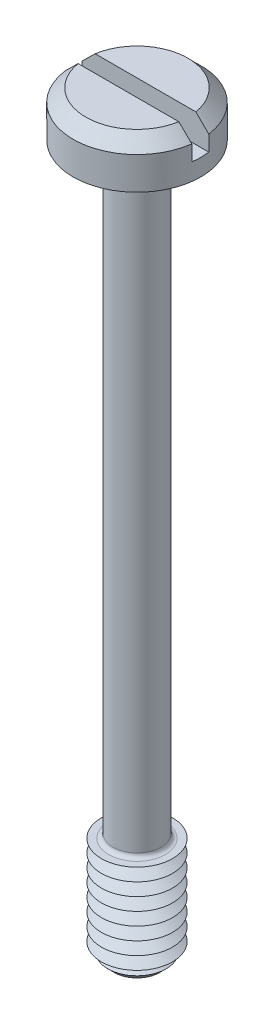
ISO-10303-21;
HEADER;
FILE_DESCRIPTION(('STEP AP214'),'2;1');
FILE_NAME('part.step','',(''),(''),'','','');
FILE_SCHEMA(('AUTOMOTIVE_DESIGN { 1 0 10303 214 1 1 1 1 }'));
ENDSEC;
DATA;
#1=APPLICATION_CONTEXT('core data for automotive mechanical design processes');
#2=APPLICATION_PROTOCOL_DEFINITION('international standard','automotive_design',2000,#1);
#3=PRODUCT_CONTEXT('',#1,'mechanical');
#4=PRODUCT('Part','Part','',(#3));
#5=PRODUCT_RELATED_PRODUCT_CATEGORY('part','',(#4));
#6=PRODUCT_DEFINITION_FORMATION('','',#4);
#7=PRODUCT_DEFINITION_CONTEXT('part definition',#1,'design');
#8=PRODUCT_DEFINITION('design','',#6,#7);
#9=PRODUCT_DEFINITION_SHAPE('','',#8);
#10=(LENGTH_UNIT() NAMED_UNIT(*) SI_UNIT(.MILLI.,.METRE.));
#11=(NAMED_UNIT(*) PLANE_ANGLE_UNIT() SI_UNIT($,.RADIAN.));
#12=(NAMED_UNIT(*) SI_UNIT($,.STERADIAN.) SOLID_ANGLE_UNIT());
#13=UNCERTAINTY_MEASURE_WITH_UNIT(LENGTH_MEASURE(1.E-05),#10,'distance_accuracy_value','');
#14=(GEOMETRIC_REPRESENTATION_CONTEXT(3) GLOBAL_UNCERTAINTY_ASSIGNED_CONTEXT((#13)) GLOBAL_UNIT_ASSIGNED_CONTEXT((#10,
#11,#12)) REPRESENTATION_CONTEXT('',''));
#15=CARTESIAN_POINT('',(0.,0.,0.));
#16=DIRECTION('',(0.,0.,1.));
#17=DIRECTION('',(1.,0.,0.));
#18=AXIS2_PLACEMENT_3D('',#15,#16,#17);
#19=CARTESIAN_POINT('',(0.,1.6,0.));
#20=DIRECTION('',(0.,1.,0.));
#21=DIRECTION('',(0.,0.,1.));
#22=AXIS2_PLACEMENT_3D('',#19,#20,#21);
#23=PLANE('',#22);
#24=DIRECTION('',(-1.,0.,0.));
#25=VECTOR('',#24,1.);
#26=CARTESIAN_POINT('',(2.25,1.6,-0.3));
#27=LINE('',#26,#25);
#28=CARTESIAN_POINT('',(1.77482393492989,1.6,-0.3));
#29=VERTEX_POINT('',#28);
#30=CARTESIAN_POINT('',(-1.77482393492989,1.6,-0.3));
#31=VERTEX_POINT('',#30);
#32=EDGE_CURVE('E110',#29,#31,#27,.T.);
#33=ORIENTED_EDGE('',*,*,#32,.F.);
#34=CARTESIAN_POINT('',(0.,1.6,0.));
#35=DIRECTION('',(0.,1.,0.));
#36=DIRECTION('',(0.,0.,1.));
#37=AXIS2_PLACEMENT_3D('',#34,#35,#36);
#38=CIRCLE('',#37,1.8);
#39=EDGE_CURVE('E113',#29,#31,#38,.T.);
#40=ORIENTED_EDGE('',*,*,#39,.T.);
#41=EDGE_LOOP('',(#33,#40));
#42=FACE_BOUND('',#41,.T.);
#43=ADVANCED_FACE('F39',(#42),#23,.T.);
#44=CARTESIAN_POINT('',(0.,1.6,0.));
#45=DIRECTION('',(0.,-1.,0.));
#46=DIRECTION('',(0.,0.,-1.));
#47=AXIS2_PLACEMENT_3D('',#44,#45,#46);
#48=CONICAL_SURFACE('',#47,1.8,0.785398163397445);
#49=CARTESIAN_POINT('',(4.95459224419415,-1.56366641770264,-0.3));
#50=CARTESIAN_POINT('',(4.78550585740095,-1.39489159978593,-0.3));
#51=CARTESIAN_POINT('',(4.61640599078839,-1.22613027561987,-0.3));
#52=CARTESIAN_POINT('',(4.27815962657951,-0.888649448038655,-0.3));
#53=CARTESIAN_POINT('',(4.10901312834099,-0.71992994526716,-0.3));
#54=CARTESIAN_POINT('',(3.77060374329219,-0.382497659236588,-0.3));
#55=CARTESIAN_POINT('',(3.601340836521,-0.213784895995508,-0.3));
#56=CARTESIAN_POINT('',(3.26272497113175,0.123545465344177,-0.3));
#57=CARTESIAN_POINT('',(3.0933720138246,0.292163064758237,-0.3));
#58=CARTESIAN_POINT('',(2.74975444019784,0.633985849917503,-0.3));
#59=CARTESIAN_POINT('',(2.57548557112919,0.807186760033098,-0.3));
#60=CARTESIAN_POINT('',(2.22666801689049,1.15332162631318,-0.3));
#61=CARTESIAN_POINT('',(2.05211932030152,1.32625557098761,-0.3));
#62=CARTESIAN_POINT('',(1.78988225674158,1.58520097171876,-0.3));
#63=CARTESIAN_POINT('',(1.70241000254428,1.67143125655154,-0.3));
#64=CARTESIAN_POINT('',(1.52723599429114,1.84366185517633,-0.3));
#65=CARTESIAN_POINT('',(1.43953423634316,1.92966216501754,-0.3));
#66=CARTESIAN_POINT('',(1.26375483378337,2.10126365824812,-0.3));
#67=CARTESIAN_POINT('',(1.17567721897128,2.18686487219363,-0.3));
#68=CARTESIAN_POINT('',(0.998839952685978,2.35735922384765,-0.3));
#69=CARTESIAN_POINT('',(0.910080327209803,2.44225238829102,-0.3));
#70=CARTESIAN_POINT('',(0.796416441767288,2.54899153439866,-0.3));
#71=CARTESIAN_POINT('',(0.772225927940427,2.57159630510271,-0.3));
#72=CARTESIAN_POINT('',(0.723692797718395,2.61664290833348,-0.3));
#73=CARTESIAN_POINT('',(0.69935017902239,2.6390847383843,-0.3));
#74=CARTESIAN_POINT('',(0.65052808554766,2.68369783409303,-0.3));
#75=CARTESIAN_POINT('',(0.626049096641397,2.70586963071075,-0.3));
#76=CARTESIAN_POINT('',(0.576826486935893,2.74991696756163,-0.3));
#77=CARTESIAN_POINT('',(0.552082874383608,2.7717925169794,-0.3));
#78=CARTESIAN_POINT('',(0.495367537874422,2.82108684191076,-0.3));
#79=CARTESIAN_POINT('',(0.463281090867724,2.84837386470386,-0.3));
#80=CARTESIAN_POINT('',(0.398023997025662,2.90193742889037,-0.3));
#81=CARTESIAN_POINT('',(0.364849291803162,2.92820913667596,-0.3));
#82=CARTESIAN_POINT('',(0.313679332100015,2.96610502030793,-0.3));
#83=CARTESIAN_POINT('',(0.296293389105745,2.97854603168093,-0.3));
#84=CARTESIAN_POINT('',(0.260958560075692,3.0025951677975,-0.3));
#85=CARTESIAN_POINT('',(0.243009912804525,3.0142036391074,-0.3));
#86=CARTESIAN_POINT('',(0.206442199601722,3.0361249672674,-0.3));
#87=CARTESIAN_POINT('',(0.187826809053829,3.04644383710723,-0.3));
#88=CARTESIAN_POINT('',(0.149667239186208,3.06515059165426,-0.3));
#89=CARTESIAN_POINT('',(0.130125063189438,3.07354243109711,-0.3));
#90=CARTESIAN_POINT('',(0.0899770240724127,3.08736060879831,-0.3));
#91=CARTESIAN_POINT('',(0.0693720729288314,3.09278944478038,-0.3));
#92=CARTESIAN_POINT('',(0.0275643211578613,3.0994305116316,-0.3));
#93=CARTESIAN_POINT('',(0.00636584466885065,3.10066782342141,-0.3));
#94=CARTESIAN_POINT('',(-0.0358007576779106,3.09861060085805,-0.3));
#95=CARTESIAN_POINT('',(-0.0567687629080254,3.09531379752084,-0.3));
#96=CARTESIAN_POINT('',(-0.0978737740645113,3.085078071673,-0.3));
#97=CARTESIAN_POINT('',(-0.118004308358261,3.07811501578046,-0.3));
#98=CARTESIAN_POINT('',(-0.162483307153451,3.05957916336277,-0.3));
#99=CARTESIAN_POINT('',(-0.186511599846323,3.04727044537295,-0.3));
#100=CARTESIAN_POINT('',(-0.233318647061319,3.02043354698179,-0.3));
#101=CARTESIAN_POINT('',(-0.256093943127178,3.00589960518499,-0.3));
#102=CARTESIAN_POINT('',(-0.300901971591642,2.97541580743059,-0.3));
#103=CARTESIAN_POINT('',(-0.322928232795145,2.95945657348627,-0.3));
#104=CARTESIAN_POINT('',(-0.366316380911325,2.9267282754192,-0.3));
#105=CARTESIAN_POINT('',(-0.387679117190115,2.90996032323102,-0.3));
#106=CARTESIAN_POINT('',(-0.433394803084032,2.87310399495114,-0.3));
#107=CARTESIAN_POINT('',(-0.457669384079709,2.85291891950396,-0.3));
#108=CARTESIAN_POINT('',(-0.505802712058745,2.81205752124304,-0.3));
#109=CARTESIAN_POINT('',(-0.529661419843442,2.79138115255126,-0.3));
#110=CARTESIAN_POINT('',(-0.600811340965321,2.7288400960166,-0.3));
#111=CARTESIAN_POINT('',(-0.647661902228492,2.68647545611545,-0.3));
#112=CARTESIAN_POINT('',(-0.740776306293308,2.60099002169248,-0.3));
#113=CARTESIAN_POINT('',(-0.787039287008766,2.55786829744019,-0.3));
#114=CARTESIAN_POINT('',(-0.879151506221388,2.47120207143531,-0.3));
#115=CARTESIAN_POINT('',(-0.925000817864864,2.4276576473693,-0.3));
#116=CARTESIAN_POINT('',(-1.0615734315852,2.29718252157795,-0.3));
#117=CARTESIAN_POINT('',(-1.15191647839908,2.20985470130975,-0.3));
#118=CARTESIAN_POINT('',(-1.33204374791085,2.0347474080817,-0.3));
#119=CARTESIAN_POINT('',(-1.42182830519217,1.94696827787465,-0.3));
#120=CARTESIAN_POINT('',(-1.65511823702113,1.71815111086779,-0.3));
#121=CARTESIAN_POINT('',(-1.79840096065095,1.57688614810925,-0.3));
#122=CARTESIAN_POINT('',(-2.08462326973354,1.2940074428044,-0.3));
#123=CARTESIAN_POINT('',(-2.22756285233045,1.15239369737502,-0.3));
#124=CARTESIAN_POINT('',(-2.6561839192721,0.727177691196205,-0.3));
#125=CARTESIAN_POINT('',(-2.94157972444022,0.443287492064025,-0.3));
#126=CARTESIAN_POINT('',(-3.51504981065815,-0.12773549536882,-0.3));
#127=CARTESIAN_POINT('',(-3.80312108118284,-0.414871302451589,-0.3));
#128=CARTESIAN_POINT('',(-4.37899985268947,-0.989219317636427,-0.3));
#129=CARTESIAN_POINT('',(-4.6668074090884,-1.27643147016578,-0.3));
#130=CARTESIAN_POINT('',(-4.95459224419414,-1.56366641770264,-0.3));
#131=B_SPLINE_CURVE_WITH_KNOTS('',3,(#49,#50,#51,#52,#53,#54,#55,#56,#57,#58,#59,#60,#61,#62,
#63,#64,#65,#66,#67,#68,#69,#70,#71,#72,#73,#74,#75,#76,#77,#78,#79,#80,#81,#82,#83,#84,#85,#86,
#87,#88,#89,#90,#91,#92,#93,#94,#95,#96,#97,#98,#99,#100,#101,#102,#103,#104,#105,#106,#107,
#108,#109,#110,#111,#112,#113,#114,#115,#116,#117,#118,#119,#120,#121,#122,#123,#124,#125,#126,
#127,#128,#129,#130),.UNSPECIFIED.,.F.,.F.,(4,2,2,2,2,2,2,2,2,2,2,2,2,2,2,2,2,2,2,2,2,2,2,2,2,2,
2,2,2,2,2,2,2,2,2,2,2,2,2,2,4),(0.,0.716712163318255,1.43343474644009,2.15039034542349,
2.8673357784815,3.6044339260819,4.3415629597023,4.71005096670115,5.07854526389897,
5.44701086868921,5.81546249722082,5.91478669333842,6.01411239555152,6.11319302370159,
6.21227057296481,6.33862193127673,6.46551497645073,6.52963544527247,6.59372906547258,
6.65751170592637,6.72116225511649,6.78475906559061,6.84797465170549,6.91122188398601,
6.97489074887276,7.05566851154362,7.13665907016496,7.21822852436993,7.29968885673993,
7.39438996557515,7.48909995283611,7.67857624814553,7.86830424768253,8.05799801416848,
8.43494407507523,8.81163695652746,9.41526715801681,10.0189023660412,11.2265436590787,
12.4467437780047,13.6665454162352),.UNSPECIFIED.);
#132=CARTESIAN_POINT('',(2.2299103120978,1.14999999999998,-0.3));
#133=VERTEX_POINT('',#132);
#134=EDGE_CURVE('E259',#133,#29,#131,.T.);
#135=ORIENTED_EDGE('',*,*,#134,.F.);
#136=CARTESIAN_POINT('',(0.,1.15,0.));
#137=DIRECTION('',(0.,1.,0.));
#138=DIRECTION('',(0.,0.,1.));
#139=AXIS2_PLACEMENT_3D('',#136,#137,#138);
#140=CIRCLE('',#139,2.25);
#141=CARTESIAN_POINT('',(-2.22991031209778,1.15,-0.3));
#142=VERTEX_POINT('',#141);
#143=EDGE_CURVE('E127',#142,#133,#140,.F.);
#144=ORIENTED_EDGE('',*,*,#143,.F.);
#145=EDGE_CURVE('E102',#31,#142,#131,.T.);
#146=ORIENTED_EDGE('',*,*,#145,.F.);
#147=ORIENTED_EDGE('',*,*,#39,.F.);
#148=EDGE_LOOP('',(#135,#144,#146,#147));
#149=FACE_BOUND('',#148,.T.);
#150=ADVANCED_FACE('F221',(#149),#48,.T.);
#151=CARTESIAN_POINT('',(0.,-25.,0.));
#152=DIRECTION('',(0.,1.,0.));
#153=DIRECTION('',(0.,0.,1.));
#154=AXIS2_PLACEMENT_3D('',#151,#152,#153);
#155=CYLINDRICAL_SURFACE('',#154,0.85);
#156=CARTESIAN_POINT('',(0.,-21.15,0.));
#157=DIRECTION('',(0.,-1.,0.));
#158=DIRECTION('',(0.,0.,-1.));
#159=AXIS2_PLACEMENT_3D('',#156,#157,#158);
#160=CIRCLE('',#159,0.85);
#161=CARTESIAN_POINT('',(0.,-21.15,-0.85));
#162=VERTEX_POINT('',#161);
#163=EDGE_CURVE('E122',#162,#162,#160,.F.);
#164=ORIENTED_EDGE('',*,*,#163,.T.);
#165=EDGE_LOOP('',(#164));
#166=FACE_BOUND('',#165,.T.);
#167=CARTESIAN_POINT('',(0.,-0.150000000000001,0.));
#168=DIRECTION('',(0.,1.,0.));
#169=DIRECTION('',(0.,0.,1.));
#170=AXIS2_PLACEMENT_3D('',#167,#168,#169);
#171=CIRCLE('',#170,0.85);
#172=CARTESIAN_POINT('',(0.,-0.150000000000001,0.85));
#173=VERTEX_POINT('',#172);
#174=EDGE_CURVE('E366',#173,#173,#171,.F.);
#175=ORIENTED_EDGE('',*,*,#174,.T.);
#176=EDGE_LOOP('',(#175));
#177=FACE_BOUND('',#176,.T.);
#178=ADVANCED_FACE('F217',(#166,#177),#155,.T.);
#179=CARTESIAN_POINT('',(0.,1.6,0.));
#180=DIRECTION('',(0.,-1.,0.));
#181=DIRECTION('',(0.,0.,-1.));
#182=AXIS2_PLACEMENT_3D('',#179,#180,#181);
#183=CYLINDRICAL_SURFACE('',#182,2.25);
#184=ORIENTED_EDGE('',*,*,#143,.T.);
#185=DIRECTION('',(0.,-1.,0.));
#186=VECTOR('',#185,1.);
#187=CARTESIAN_POINT('',(2.22991031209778,1.6,-0.3));
#188=LINE('',#187,#186);
#189=CARTESIAN_POINT('',(2.22991031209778,0.6,-0.3));
#190=VERTEX_POINT('',#189);
#191=EDGE_CURVE('E64',#133,#190,#188,.T.);
#192=ORIENTED_EDGE('',*,*,#191,.T.);
#193=CARTESIAN_POINT('',(0.,0.6,0.));
#194=DIRECTION('',(0.,1.,0.));
#195=DIRECTION('',(0.,0.,1.));
#196=AXIS2_PLACEMENT_3D('',#193,#194,#195);
#197=CIRCLE('',#196,2.25);
#198=CARTESIAN_POINT('',(2.22991031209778,0.6,0.3));
#199=VERTEX_POINT('',#198);
#200=EDGE_CURVE('E11',#199,#190,#197,.T.);
#201=ORIENTED_EDGE('',*,*,#200,.F.);
#202=DIRECTION('',(0.,-1.,0.));
#203=VECTOR('',#202,1.);
#204=CARTESIAN_POINT('',(2.22991031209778,1.6,0.3));
#205=LINE('',#204,#203);
#206=CARTESIAN_POINT('',(2.22991031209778,1.15,0.3));
#207=VERTEX_POINT('',#206);
#208=EDGE_CURVE('E277',#199,#207,#205,.F.);
#209=ORIENTED_EDGE('',*,*,#208,.T.);
#210=CARTESIAN_POINT('',(-2.2299103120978,1.14999999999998,0.3));
#211=VERTEX_POINT('',#210);
#212=EDGE_CURVE('E119',#207,#211,#140,.F.);
#213=ORIENTED_EDGE('',*,*,#212,.T.);
#214=DIRECTION('',(0.,-1.,0.));
#215=VECTOR('',#214,1.);
#216=CARTESIAN_POINT('',(-2.22991031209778,1.6,0.3));
#217=LINE('',#216,#215);
#218=CARTESIAN_POINT('',(-2.22991031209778,0.6,0.3));
#219=VERTEX_POINT('',#218);
#220=EDGE_CURVE('E96',#211,#219,#217,.T.);
#221=ORIENTED_EDGE('',*,*,#220,.T.);
#222=CARTESIAN_POINT('',(-2.22991031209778,0.6,-0.3));
#223=VERTEX_POINT('',#222);
#224=EDGE_CURVE('E44',#223,#219,#197,.T.);
#225=ORIENTED_EDGE('',*,*,#224,.F.);
#226=DIRECTION('',(0.,-1.,0.));
#227=VECTOR('',#226,1.);
#228=CARTESIAN_POINT('',(-2.22991031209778,1.6,-0.3));
#229=LINE('',#228,#227);
#230=EDGE_CURVE('E282',#223,#142,#229,.F.);
#231=ORIENTED_EDGE('',*,*,#230,.T.);
#232=EDGE_LOOP('',(#184,#192,#201,#209,#213,#221,#225,#231));
#233=FACE_BOUND('',#232,.T.);
#234=CARTESIAN_POINT('',(0.,0.,0.));
#235=DIRECTION('',(0.,1.,0.));
#236=DIRECTION('',(0.,0.,1.));
#237=AXIS2_PLACEMENT_3D('',#234,#235,#236);
#238=CIRCLE('',#237,2.25);
#239=CARTESIAN_POINT('',(0.,0.,2.25));
#240=VERTEX_POINT('',#239);
#241=EDGE_CURVE('E352',#240,#240,#238,.T.);
#242=ORIENTED_EDGE('',*,*,#241,.T.);
#243=EDGE_LOOP('',(#242));
#244=FACE_BOUND('',#243,.T.);
#245=ADVANCED_FACE('F220',(#233,#244),#183,.T.);
#246=DIRECTION('',(1.,0.,0.));
#247=VECTOR('',#246,1.);
#248=CARTESIAN_POINT('',(2.25,1.6,0.3));
#249=LINE('',#248,#247);
#250=CARTESIAN_POINT('',(-1.77482393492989,1.6,0.3));
#251=VERTEX_POINT('',#250);
#252=CARTESIAN_POINT('',(1.77482393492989,1.6,0.3));
#253=VERTEX_POINT('',#252);
#254=EDGE_CURVE('E56',#251,#253,#249,.T.);
#255=ORIENTED_EDGE('',*,*,#254,.F.);
#256=EDGE_CURVE('E108',#251,#253,#38,.T.);
#257=ORIENTED_EDGE('',*,*,#256,.T.);
#258=EDGE_LOOP('',(#255,#257));
#259=FACE_BOUND('',#258,.T.);
#260=ADVANCED_FACE('F107',(#259),#23,.T.);
#261=CARTESIAN_POINT('',(0.,0.,0.));
#262=DIRECTION('',(0.,1.,0.));
#263=DIRECTION('',(0.,0.,1.));
#264=AXIS2_PLACEMENT_3D('',#261,#262,#263);
#265=PLANE('',#264);
#266=CARTESIAN_POINT('',(0.,0.,0.));
#267=DIRECTION('',(0.,1.,0.));
#268=DIRECTION('',(0.,0.,1.));
#269=AXIS2_PLACEMENT_3D('',#266,#267,#268);
#270=CIRCLE('',#269,1.);
#271=CARTESIAN_POINT('',(0.,0.,1.));
#272=VERTEX_POINT('',#271);
#273=EDGE_CURVE('E114',#272,#272,#270,.T.);
#274=ORIENTED_EDGE('',*,*,#273,.T.);
#275=EDGE_LOOP('',(#274));
#276=FACE_BOUND('',#275,.T.);
#277=ORIENTED_EDGE('',*,*,#241,.F.);
#278=EDGE_LOOP('',(#277));
#279=FACE_BOUND('',#278,.T.);
#280=ADVANCED_FACE('F211',(#276,#279),#265,.F.);
#281=CARTESIAN_POINT('',(0.,-21.3,0.));
#282=DIRECTION('',(0.,-1.,0.));
#283=DIRECTION('',(0.,0.,-1.));
#284=AXIS2_PLACEMENT_3D('',#281,#282,#283);
#285=PLANE('',#284);
#286=CARTESIAN_POINT('',(0.,-21.3,0.));
#287=DIRECTION('',(0.,-1.,0.));
#288=DIRECTION('',(0.,0.,-1.));
#289=AXIS2_PLACEMENT_3D('',#286,#287,#288);
#290=CIRCLE('',#289,1.);
#291=CARTESIAN_POINT('',(0.,-21.3,-1.));
#292=VERTEX_POINT('',#291);
#293=EDGE_CURVE('E359',#292,#292,#290,.T.);
#294=ORIENTED_EDGE('',*,*,#293,.T.);
#295=EDGE_LOOP('',(#294));
#296=FACE_BOUND('',#295,.T.);
#297=CARTESIAN_POINT('',(0.,-21.3,0.));
#298=DIRECTION('',(0.,1.,0.));
#299=DIRECTION('',(0.,0.,1.));
#300=AXIS2_PLACEMENT_3D('',#297,#298,#299);
#301=CIRCLE('',#300,1.25);
#302=CARTESIAN_POINT('',(0.,-21.3,1.25));
#303=VERTEX_POINT('',#302);
#304=EDGE_CURVE('E349',#303,#303,#301,.T.);
#305=ORIENTED_EDGE('',*,*,#304,.T.);
#306=EDGE_LOOP('',(#305));
#307=FACE_BOUND('',#306,.T.);
#308=ADVANCED_FACE('F207',(#296,#307),#285,.F.);
#309=CARTESIAN_POINT('',(0.,-21.525,0.));
#310=DIRECTION('',(0.,1.,0.));
#311=DIRECTION('',(0.,0.,1.));
#312=AXIS2_PLACEMENT_3D('',#309,#310,#311);
#313=CONICAL_SURFACE('',#312,0.860288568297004,1.0471975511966);
#314=ORIENTED_EDGE('',*,*,#304,.F.);
#315=EDGE_LOOP('',(#314));
#316=FACE_BOUND('',#315,.T.);
#317=CARTESIAN_POINT('',(0.,-21.525,0.));
#318=DIRECTION('',(0.,1.,0.));
#319=DIRECTION('',(0.,0.,1.));
#320=AXIS2_PLACEMENT_3D('',#317,#318,#319);
#321=CIRCLE('',#320,0.860288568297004);
#322=CARTESIAN_POINT('',(0.,-21.525,0.860288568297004));
#323=VERTEX_POINT('',#322);
#324=EDGE_CURVE('E345',#323,#323,#321,.T.);
#325=ORIENTED_EDGE('',*,*,#324,.T.);
#326=EDGE_LOOP('',(#325));
#327=FACE_BOUND('',#326,.T.);
#328=ADVANCED_FACE('F203',(#316,#327),#313,.T.);
#329=CARTESIAN_POINT('',(0.,-21.75,0.));
#330=DIRECTION('',(0.,-1.,0.));
#331=DIRECTION('',(0.,0.,-1.));
#332=AXIS2_PLACEMENT_3D('',#329,#330,#331);
#333=CONICAL_SURFACE('',#332,1.25,1.0471975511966);
#334=ORIENTED_EDGE('',*,*,#324,.F.);
#335=EDGE_LOOP('',(#334));
#336=FACE_BOUND('',#335,.T.);
#337=CARTESIAN_POINT('',(0.,-21.75,0.));
#338=DIRECTION('',(0.,1.,0.));
#339=DIRECTION('',(0.,0.,1.));
#340=AXIS2_PLACEMENT_3D('',#337,#338,#339);
#341=CIRCLE('',#340,1.25);
#342=CARTESIAN_POINT('',(0.,-21.75,1.25));
#343=VERTEX_POINT('',#342);
#344=EDGE_CURVE('E341',#343,#343,#341,.T.);
#345=ORIENTED_EDGE('',*,*,#344,.T.);
#346=EDGE_LOOP('',(#345));
#347=FACE_BOUND('',#346,.T.);
#348=ADVANCED_FACE('F199',(#336,#347),#333,.T.);
#349=CARTESIAN_POINT('',(0.,-21.975,0.));
#350=DIRECTION('',(0.,1.,0.));
#351=DIRECTION('',(0.,0.,1.));
#352=AXIS2_PLACEMENT_3D('',#349,#350,#351);
#353=CONICAL_SURFACE('',#352,0.860288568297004,1.0471975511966);
#354=ORIENTED_EDGE('',*,*,#344,.F.);
#355=EDGE_LOOP('',(#354));
#356=FACE_BOUND('',#355,.T.);
#357=CARTESIAN_POINT('',(0.,-21.975,0.));
#358=DIRECTION('',(0.,1.,0.));
#359=DIRECTION('',(0.,0.,1.));
#360=AXIS2_PLACEMENT_3D('',#357,#358,#359);
#361=CIRCLE('',#360,0.860288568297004);
#362=CARTESIAN_POINT('',(0.,-21.975,0.860288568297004));
#363=VERTEX_POINT('',#362);
#364=EDGE_CURVE('E337',#363,#363,#361,.T.);
#365=ORIENTED_EDGE('',*,*,#364,.T.);
#366=EDGE_LOOP('',(#365));
#367=FACE_BOUND('',#366,.T.);
#368=ADVANCED_FACE('F195',(#356,#367),#353,.T.);
#369=CARTESIAN_POINT('',(0.,-22.2,0.));
#370=DIRECTION('',(0.,-1.,0.));
#371=DIRECTION('',(0.,0.,-1.));
#372=AXIS2_PLACEMENT_3D('',#369,#370,#371);
#373=CONICAL_SURFACE('',#372,1.25,1.0471975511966);
#374=ORIENTED_EDGE('',*,*,#364,.F.);
#375=EDGE_LOOP('',(#374));
#376=FACE_BOUND('',#375,.T.);
#377=CARTESIAN_POINT('',(0.,-22.2,0.));
#378=DIRECTION('',(0.,1.,0.));
#379=DIRECTION('',(0.,0.,1.));
#380=AXIS2_PLACEMENT_3D('',#377,#378,#379);
#381=CIRCLE('',#380,1.25);
#382=CARTESIAN_POINT('',(0.,-22.2,1.25));
#383=VERTEX_POINT('',#382);
#384=EDGE_CURVE('E333',#383,#383,#381,.T.);
#385=ORIENTED_EDGE('',*,*,#384,.T.);
#386=EDGE_LOOP('',(#385));
#387=FACE_BOUND('',#386,.T.);
#388=ADVANCED_FACE('F191',(#376,#387),#373,.T.);
#389=CARTESIAN_POINT('',(0.,-22.425,0.));
#390=DIRECTION('',(0.,1.,0.));
#391=DIRECTION('',(0.,0.,1.));
#392=AXIS2_PLACEMENT_3D('',#389,#390,#391);
#393=CONICAL_SURFACE('',#392,0.860288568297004,1.0471975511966);
#394=ORIENTED_EDGE('',*,*,#384,.F.);
#395=EDGE_LOOP('',(#394));
#396=FACE_BOUND('',#395,.T.);
#397=CARTESIAN_POINT('',(0.,-22.425,0.));
#398=DIRECTION('',(0.,1.,0.));
#399=DIRECTION('',(0.,0.,1.));
#400=AXIS2_PLACEMENT_3D('',#397,#398,#399);
#401=CIRCLE('',#400,0.860288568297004);
#402=CARTESIAN_POINT('',(0.,-22.425,0.860288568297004));
#403=VERTEX_POINT('',#402);
#404=EDGE_CURVE('E329',#403,#403,#401,.T.);
#405=ORIENTED_EDGE('',*,*,#404,.T.);
#406=EDGE_LOOP('',(#405));
#407=FACE_BOUND('',#406,.T.);
#408=ADVANCED_FACE('F187',(#396,#407),#393,.T.);
#409=CARTESIAN_POINT('',(0.,-22.65,0.));
#410=DIRECTION('',(0.,-1.,0.));
#411=DIRECTION('',(0.,0.,-1.));
#412=AXIS2_PLACEMENT_3D('',#409,#410,#411);
#413=CONICAL_SURFACE('',#412,1.25,1.0471975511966);
#414=ORIENTED_EDGE('',*,*,#404,.F.);
#415=EDGE_LOOP('',(#414));
#416=FACE_BOUND('',#415,.T.);
#417=CARTESIAN_POINT('',(0.,-22.65,0.));
#418=DIRECTION('',(0.,1.,0.));
#419=DIRECTION('',(0.,0.,1.));
#420=AXIS2_PLACEMENT_3D('',#417,#418,#419);
#421=CIRCLE('',#420,1.25);
#422=CARTESIAN_POINT('',(0.,-22.65,1.25));
#423=VERTEX_POINT('',#422);
#424=EDGE_CURVE('E325',#423,#423,#421,.T.);
#425=ORIENTED_EDGE('',*,*,#424,.T.);
#426=EDGE_LOOP('',(#425));
#427=FACE_BOUND('',#426,.T.);
#428=ADVANCED_FACE('F183',(#416,#427),#413,.T.);
#429=CARTESIAN_POINT('',(0.,-22.875,0.));
#430=DIRECTION('',(0.,1.,0.));
#431=DIRECTION('',(0.,0.,1.));
#432=AXIS2_PLACEMENT_3D('',#429,#430,#431);
#433=CONICAL_SURFACE('',#432,0.860288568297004,1.0471975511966);
#434=ORIENTED_EDGE('',*,*,#424,.F.);
#435=EDGE_LOOP('',(#434));
#436=FACE_BOUND('',#435,.T.);
#437=CARTESIAN_POINT('',(0.,-22.875,0.));
#438=DIRECTION('',(0.,1.,0.));
#439=DIRECTION('',(0.,0.,1.));
#440=AXIS2_PLACEMENT_3D('',#437,#438,#439);
#441=CIRCLE('',#440,0.860288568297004);
#442=CARTESIAN_POINT('',(0.,-22.875,0.860288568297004));
#443=VERTEX_POINT('',#442);
#444=EDGE_CURVE('E321',#443,#443,#441,.T.);
#445=ORIENTED_EDGE('',*,*,#444,.T.);
#446=EDGE_LOOP('',(#445));
#447=FACE_BOUND('',#446,.T.);
#448=ADVANCED_FACE('F179',(#436,#447),#433,.T.);
#449=CARTESIAN_POINT('',(0.,-23.1,0.));
#450=DIRECTION('',(0.,-1.,0.));
#451=DIRECTION('',(0.,0.,-1.));
#452=AXIS2_PLACEMENT_3D('',#449,#450,#451);
#453=CONICAL_SURFACE('',#452,1.25,1.0471975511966);
#454=ORIENTED_EDGE('',*,*,#444,.F.);
#455=EDGE_LOOP('',(#454));
#456=FACE_BOUND('',#455,.T.);
#457=CARTESIAN_POINT('',(0.,-23.1,0.));
#458=DIRECTION('',(0.,1.,0.));
#459=DIRECTION('',(0.,0.,1.));
#460=AXIS2_PLACEMENT_3D('',#457,#458,#459);
#461=CIRCLE('',#460,1.25);
#462=CARTESIAN_POINT('',(0.,-23.1,1.25));
#463=VERTEX_POINT('',#462);
#464=EDGE_CURVE('E317',#463,#463,#461,.T.);
#465=ORIENTED_EDGE('',*,*,#464,.T.);
#466=EDGE_LOOP('',(#465));
#467=FACE_BOUND('',#466,.T.);
#468=ADVANCED_FACE('F175',(#456,#467),#453,.T.);
#469=CARTESIAN_POINT('',(0.,-23.325,0.));
#470=DIRECTION('',(0.,1.,0.));
#471=DIRECTION('',(0.,0.,1.));
#472=AXIS2_PLACEMENT_3D('',#469,#470,#471);
#473=CONICAL_SURFACE('',#472,0.860288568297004,1.0471975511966);
#474=ORIENTED_EDGE('',*,*,#464,.F.);
#475=EDGE_LOOP('',(#474));
#476=FACE_BOUND('',#475,.T.);
#477=CARTESIAN_POINT('',(0.,-23.325,0.));
#478=DIRECTION('',(0.,1.,0.));
#479=DIRECTION('',(0.,0.,1.));
#480=AXIS2_PLACEMENT_3D('',#477,#478,#479);
#481=CIRCLE('',#480,0.860288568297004);
#482=CARTESIAN_POINT('',(0.,-23.325,0.860288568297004));
#483=VERTEX_POINT('',#482);
#484=EDGE_CURVE('E314',#483,#483,#481,.T.);
#485=ORIENTED_EDGE('',*,*,#484,.T.);
#486=EDGE_LOOP('',(#485));
#487=FACE_BOUND('',#486,.T.);
#488=ADVANCED_FACE('F171',(#476,#487),#473,.T.);
#489=CARTESIAN_POINT('',(0.,-23.55,0.));
#490=DIRECTION('',(0.,-1.,0.));
#491=DIRECTION('',(0.,0.,-1.));
#492=AXIS2_PLACEMENT_3D('',#489,#490,#491);
#493=CONICAL_SURFACE('',#492,1.25,1.0471975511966);
#494=ORIENTED_EDGE('',*,*,#484,.F.);
#495=EDGE_LOOP('',(#494));
#496=FACE_BOUND('',#495,.T.);
#497=CARTESIAN_POINT('',(0.,-23.55,0.));
#498=DIRECTION('',(0.,1.,0.));
#499=DIRECTION('',(0.,0.,1.));
#500=AXIS2_PLACEMENT_3D('',#497,#498,#499);
#501=CIRCLE('',#500,1.25);
#502=CARTESIAN_POINT('',(0.,-23.55,1.25));
#503=VERTEX_POINT('',#502);
#504=EDGE_CURVE('E310',#503,#503,#501,.T.);
#505=ORIENTED_EDGE('',*,*,#504,.T.);
#506=EDGE_LOOP('',(#505));
#507=FACE_BOUND('',#506,.T.);
#508=ADVANCED_FACE('F167',(#496,#507),#493,.T.);
#509=CARTESIAN_POINT('',(0.,-23.775,0.));
#510=DIRECTION('',(0.,1.,0.));
#511=DIRECTION('',(0.,0.,1.));
#512=AXIS2_PLACEMENT_3D('',#509,#510,#511);
#513=CONICAL_SURFACE('',#512,0.860288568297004,1.0471975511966);
#514=ORIENTED_EDGE('',*,*,#504,.F.);
#515=EDGE_LOOP('',(#514));
#516=FACE_BOUND('',#515,.T.);
#517=CARTESIAN_POINT('',(0.,-23.775,0.));
#518=DIRECTION('',(0.,1.,0.));
#519=DIRECTION('',(0.,0.,1.));
#520=AXIS2_PLACEMENT_3D('',#517,#518,#519);
#521=CIRCLE('',#520,0.860288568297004);
#522=CARTESIAN_POINT('',(0.,-23.775,0.860288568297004));
#523=VERTEX_POINT('',#522);
#524=EDGE_CURVE('E306',#523,#523,#521,.T.);
#525=ORIENTED_EDGE('',*,*,#524,.T.);
#526=EDGE_LOOP('',(#525));
#527=FACE_BOUND('',#526,.T.);
#528=ADVANCED_FACE('F163',(#516,#527),#513,.T.);
#529=CARTESIAN_POINT('',(0.,-24.,0.));
#530=DIRECTION('',(0.,-1.,0.));
#531=DIRECTION('',(0.,0.,-1.));
#532=AXIS2_PLACEMENT_3D('',#529,#530,#531);
#533=CONICAL_SURFACE('',#532,1.25,1.0471975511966);
#534=ORIENTED_EDGE('',*,*,#524,.F.);
#535=EDGE_LOOP('',(#534));
#536=FACE_BOUND('',#535,.T.);
#537=CARTESIAN_POINT('',(0.,-24.,0.));
#538=DIRECTION('',(0.,1.,0.));
#539=DIRECTION('',(0.,0.,1.));
#540=AXIS2_PLACEMENT_3D('',#537,#538,#539);
#541=CIRCLE('',#540,1.25);
#542=CARTESIAN_POINT('',(0.,-24.,1.25));
#543=VERTEX_POINT('',#542);
#544=EDGE_CURVE('E303',#543,#543,#541,.T.);
#545=ORIENTED_EDGE('',*,*,#544,.T.);
#546=EDGE_LOOP('',(#545));
#547=FACE_BOUND('',#546,.T.);
#548=ADVANCED_FACE('F159',(#536,#547),#533,.T.);
#549=CARTESIAN_POINT('',(0.,-24.225,0.));
#550=DIRECTION('',(0.,1.,0.));
#551=DIRECTION('',(0.,0.,1.));
#552=AXIS2_PLACEMENT_3D('',#549,#550,#551);
#553=CONICAL_SURFACE('',#552,0.860288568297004,1.0471975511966);
#554=ORIENTED_EDGE('',*,*,#544,.F.);
#555=EDGE_LOOP('',(#554));
#556=FACE_BOUND('',#555,.T.);
#557=CARTESIAN_POINT('',(0.,-24.225,0.));
#558=DIRECTION('',(0.,1.,0.));
#559=DIRECTION('',(0.,0.,1.));
#560=AXIS2_PLACEMENT_3D('',#557,#558,#559);
#561=CIRCLE('',#560,0.860288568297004);
#562=CARTESIAN_POINT('',(0.,-24.225,0.860288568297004));
#563=VERTEX_POINT('',#562);
#564=EDGE_CURVE('E299',#563,#563,#561,.T.);
#565=ORIENTED_EDGE('',*,*,#564,.T.);
#566=EDGE_LOOP('',(#565));
#567=FACE_BOUND('',#566,.T.);
#568=ADVANCED_FACE('F155',(#556,#567),#553,.T.);
#569=CARTESIAN_POINT('',(0.,-24.45,0.));
#570=DIRECTION('',(0.,-1.,0.));
#571=DIRECTION('',(0.,0.,-1.));
#572=AXIS2_PLACEMENT_3D('',#569,#570,#571);
#573=CONICAL_SURFACE('',#572,1.25,1.0471975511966);
#574=ORIENTED_EDGE('',*,*,#564,.F.);
#575=EDGE_LOOP('',(#574));
#576=FACE_BOUND('',#575,.T.);
#577=CARTESIAN_POINT('',(0.,-24.45,0.));
#578=DIRECTION('',(0.,1.,0.));
#579=DIRECTION('',(0.,0.,1.));
#580=AXIS2_PLACEMENT_3D('',#577,#578,#579);
#581=CIRCLE('',#580,1.25);
#582=CARTESIAN_POINT('',(0.,-24.45,1.25));
#583=VERTEX_POINT('',#582);
#584=EDGE_CURVE('E295',#583,#583,#581,.T.);
#585=ORIENTED_EDGE('',*,*,#584,.T.);
#586=EDGE_LOOP('',(#585));
#587=FACE_BOUND('',#586,.T.);
#588=ADVANCED_FACE('F151',(#576,#587),#573,.T.);
#589=CARTESIAN_POINT('',(0.,-24.675,0.));
#590=DIRECTION('',(0.,1.,0.));
#591=DIRECTION('',(0.,0.,1.));
#592=AXIS2_PLACEMENT_3D('',#589,#590,#591);
#593=CONICAL_SURFACE('',#592,0.860288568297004,1.0471975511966);
#594=ORIENTED_EDGE('',*,*,#584,.F.);
#595=EDGE_LOOP('',(#594));
#596=FACE_BOUND('',#595,.T.);
#597=CARTESIAN_POINT('',(0.,-24.675,0.));
#598=DIRECTION('',(0.,1.,0.));
#599=DIRECTION('',(0.,0.,1.));
#600=AXIS2_PLACEMENT_3D('',#597,#598,#599);
#601=CIRCLE('',#600,0.860288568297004);
#602=CARTESIAN_POINT('',(0.,-24.675,0.860288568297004));
#603=VERTEX_POINT('',#602);
#604=EDGE_CURVE('E291',#603,#603,#601,.T.);
#605=ORIENTED_EDGE('',*,*,#604,.T.);
#606=EDGE_LOOP('',(#605));
#607=FACE_BOUND('',#606,.T.);
#608=ADVANCED_FACE('F147',(#596,#607),#593,.T.);
#609=CARTESIAN_POINT('',(0.,-24.9,0.));
#610=DIRECTION('',(0.,-1.,0.));
#611=DIRECTION('',(0.,0.,-1.));
#612=AXIS2_PLACEMENT_3D('',#609,#610,#611);
#613=CONICAL_SURFACE('',#612,1.25,1.0471975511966);
#614=CARTESIAN_POINT('',(0.,-24.7718911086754,0.));
#615=DIRECTION('',(0.,-1.,0.));
#616=DIRECTION('',(0.,0.,-1.));
#617=AXIS2_PLACEMENT_3D('',#614,#615,#616);
#618=CIRCLE('',#617,1.02810889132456);
#619=CARTESIAN_POINT('',(0.,-24.7718911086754,-1.02810889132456));
#620=VERTEX_POINT('',#619);
#621=EDGE_CURVE('E298',#620,#620,#618,.F.);
#622=ORIENTED_EDGE('',*,*,#621,.T.);
#623=EDGE_LOOP('',(#622));
#624=FACE_BOUND('',#623,.T.);
#625=ORIENTED_EDGE('',*,*,#604,.F.);
#626=EDGE_LOOP('',(#625));
#627=FACE_BOUND('',#626,.T.);
#628=ADVANCED_FACE('F143',(#624,#627),#613,.T.);
#629=CARTESIAN_POINT('',(0.,-25.,0.));
#630=DIRECTION('',(0.,-1.,0.));
#631=DIRECTION('',(0.,0.,-1.));
#632=AXIS2_PLACEMENT_3D('',#629,#630,#631);
#633=PLANE('',#632);
#634=CARTESIAN_POINT('',(0.,-25.,0.));
#635=DIRECTION('',(0.,-1.,0.));
#636=DIRECTION('',(0.,0.,-1.));
#637=AXIS2_PLACEMENT_3D('',#634,#635,#636);
#638=CIRCLE('',#637,0.800000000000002);
#639=CARTESIAN_POINT('',(0.,-25.,-0.800000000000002));
#640=VERTEX_POINT('',#639);
#641=EDGE_CURVE('E355',#640,#640,#638,.T.);
#642=ORIENTED_EDGE('',*,*,#641,.T.);
#643=EDGE_LOOP('',(#642));
#644=FACE_BOUND('',#643,.T.);
#645=ADVANCED_FACE('F146',(#644),#633,.T.);
#646=CARTESIAN_POINT('',(0.,-25.,0.));
#647=DIRECTION('',(0.,1.,0.));
#648=DIRECTION('',(0.,0.,1.));
#649=AXIS2_PLACEMENT_3D('',#646,#647,#648);
#650=CONICAL_SURFACE('',#649,0.800000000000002,0.785398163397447);
#651=ORIENTED_EDGE('',*,*,#621,.F.);
#652=EDGE_LOOP('',(#651));
#653=FACE_BOUND('',#652,.T.);
#654=ORIENTED_EDGE('',*,*,#641,.F.);
#655=EDGE_LOOP('',(#654));
#656=FACE_BOUND('',#655,.T.);
#657=ADVANCED_FACE('F215',(#653,#656),#650,.T.);
#658=CARTESIAN_POINT('',(0.,-21.15,0.));
#659=DIRECTION('',(0.,-1.,0.));
#660=DIRECTION('',(0.,0.,-1.));
#661=AXIS2_PLACEMENT_3D('',#658,#659,#660);
#662=TOROIDAL_SURFACE('',#661,1.,0.15);
#663=ORIENTED_EDGE('',*,*,#163,.F.);
#664=EDGE_LOOP('',(#663));
#665=FACE_BOUND('',#664,.T.);
#666=ORIENTED_EDGE('',*,*,#293,.F.);
#667=EDGE_LOOP('',(#666));
#668=FACE_BOUND('',#667,.T.);
#669=ADVANCED_FACE('F233',(#665,#668),#662,.F.);
#670=CARTESIAN_POINT('',(0.,-0.150000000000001,0.));
#671=DIRECTION('',(0.,1.,0.));
#672=DIRECTION('',(0.,0.,1.));
#673=AXIS2_PLACEMENT_3D('',#670,#671,#672);
#674=TOROIDAL_SURFACE('',#673,1.,0.15);
#675=ORIENTED_EDGE('',*,*,#273,.F.);
#676=EDGE_LOOP('',(#675));
#677=FACE_BOUND('',#676,.T.);
#678=ORIENTED_EDGE('',*,*,#174,.F.);
#679=EDGE_LOOP('',(#678));
#680=FACE_BOUND('',#679,.T.);
#681=ADVANCED_FACE('F236',(#677,#680),#674,.F.);
#682=CARTESIAN_POINT('',(-4.95459224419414,-1.56366641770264,0.3));
#683=CARTESIAN_POINT('',(-4.78550585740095,-1.39489159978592,0.3));
#684=CARTESIAN_POINT('',(-4.61640599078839,-1.22613027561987,0.3));
#685=CARTESIAN_POINT('',(-4.27815962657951,-0.888649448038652,0.3));
#686=CARTESIAN_POINT('',(-4.10901312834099,-0.719929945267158,0.3));
#687=CARTESIAN_POINT('',(-3.77060374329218,-0.382497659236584,0.3));
#688=CARTESIAN_POINT('',(-3.60134083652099,-0.213784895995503,0.3));
#689=CARTESIAN_POINT('',(-3.26272497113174,0.123545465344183,0.3));
#690=CARTESIAN_POINT('',(-3.09337201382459,0.292163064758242,0.3));
#691=CARTESIAN_POINT('',(-2.74975444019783,0.633985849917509,0.3));
#692=CARTESIAN_POINT('',(-2.57548557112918,0.807186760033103,0.3));
#693=CARTESIAN_POINT('',(-2.22666801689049,1.15332162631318,0.3));
#694=CARTESIAN_POINT('',(-2.05211932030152,1.32625557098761,0.3));
#695=CARTESIAN_POINT('',(-1.78988225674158,1.58520097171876,0.3));
#696=CARTESIAN_POINT('',(-1.70241000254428,1.67143125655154,0.3));
#697=CARTESIAN_POINT('',(-1.52723599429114,1.84366185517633,0.3));
#698=CARTESIAN_POINT('',(-1.43953423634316,1.92966216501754,0.3));
#699=CARTESIAN_POINT('',(-1.26375483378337,2.10126365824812,0.3));
#700=CARTESIAN_POINT('',(-1.17567721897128,2.18686487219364,0.3));
#701=CARTESIAN_POINT('',(-0.998839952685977,2.35735922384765,0.3));
#702=CARTESIAN_POINT('',(-0.910080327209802,2.44225238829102,0.3));
#703=CARTESIAN_POINT('',(-0.796416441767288,2.54899153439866,0.3));
#704=CARTESIAN_POINT('',(-0.772225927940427,2.57159630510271,0.3));
#705=CARTESIAN_POINT('',(-0.723692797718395,2.61664290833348,0.3));
#706=CARTESIAN_POINT('',(-0.69935017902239,2.6390847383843,0.3));
#707=CARTESIAN_POINT('',(-0.65052808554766,2.68369783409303,0.3));
#708=CARTESIAN_POINT('',(-0.626049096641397,2.70586963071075,0.3));
#709=CARTESIAN_POINT('',(-0.576826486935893,2.74991696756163,0.3));
#710=CARTESIAN_POINT('',(-0.552082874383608,2.7717925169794,0.3));
#711=CARTESIAN_POINT('',(-0.495367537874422,2.82108684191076,0.3));
#712=CARTESIAN_POINT('',(-0.463281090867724,2.84837386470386,0.3));
#713=CARTESIAN_POINT('',(-0.398023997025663,2.90193742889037,0.3));
#714=CARTESIAN_POINT('',(-0.364849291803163,2.92820913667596,0.3));
#715=CARTESIAN_POINT('',(-0.313679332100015,2.96610502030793,0.3));
#716=CARTESIAN_POINT('',(-0.296293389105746,2.97854603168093,0.3));
#717=CARTESIAN_POINT('',(-0.260958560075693,3.0025951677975,0.3));
#718=CARTESIAN_POINT('',(-0.243009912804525,3.0142036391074,0.3));
#719=CARTESIAN_POINT('',(-0.206442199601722,3.0361249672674,0.3));
#720=CARTESIAN_POINT('',(-0.187826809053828,3.04644383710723,0.3));
#721=CARTESIAN_POINT('',(-0.149667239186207,3.06515059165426,0.3));
#722=CARTESIAN_POINT('',(-0.130125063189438,3.07354243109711,0.3));
#723=CARTESIAN_POINT('',(-0.0899770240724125,3.08736060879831,0.3));
#724=CARTESIAN_POINT('',(-0.0693720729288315,3.09278944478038,0.3));
#725=CARTESIAN_POINT('',(-0.0275643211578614,3.0994305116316,0.3));
#726=CARTESIAN_POINT('',(-0.00636584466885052,3.10066782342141,0.3));
#727=CARTESIAN_POINT('',(0.0358007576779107,3.09861060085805,0.3));
#728=CARTESIAN_POINT('',(0.0567687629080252,3.09531379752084,0.3));
#729=CARTESIAN_POINT('',(0.097873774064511,3.085078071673,0.3));
#730=CARTESIAN_POINT('',(0.118004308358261,3.07811501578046,0.3));
#731=CARTESIAN_POINT('',(0.162483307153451,3.05957916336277,0.3));
#732=CARTESIAN_POINT('',(0.186511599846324,3.04727044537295,0.3));
#733=CARTESIAN_POINT('',(0.23331864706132,3.02043354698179,0.3));
#734=CARTESIAN_POINT('',(0.256093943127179,3.00589960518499,0.3));
#735=CARTESIAN_POINT('',(0.300901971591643,2.97541580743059,0.3));
#736=CARTESIAN_POINT('',(0.322928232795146,2.95945657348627,0.3));
#737=CARTESIAN_POINT('',(0.366316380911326,2.9267282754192,0.3));
#738=CARTESIAN_POINT('',(0.387679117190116,2.90996032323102,0.3));
#739=CARTESIAN_POINT('',(0.433394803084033,2.87310399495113,0.3));
#740=CARTESIAN_POINT('',(0.457669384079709,2.85291891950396,0.3));
#741=CARTESIAN_POINT('',(0.505802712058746,2.81205752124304,0.3));
#742=CARTESIAN_POINT('',(0.529661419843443,2.79138115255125,0.3));
#743=CARTESIAN_POINT('',(0.600811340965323,2.7288400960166,0.3));
#744=CARTESIAN_POINT('',(0.647661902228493,2.68647545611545,0.3));
#745=CARTESIAN_POINT('',(0.740776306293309,2.60099002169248,0.3));
#746=CARTESIAN_POINT('',(0.787039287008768,2.55786829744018,0.3));
#747=CARTESIAN_POINT('',(0.879151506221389,2.47120207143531,0.3));
#748=CARTESIAN_POINT('',(0.925000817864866,2.42765764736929,0.3));
#749=CARTESIAN_POINT('',(1.0615734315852,2.29718252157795,0.3));
#750=CARTESIAN_POINT('',(1.15191647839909,2.20985470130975,0.3));
#751=CARTESIAN_POINT('',(1.33204374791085,2.0347474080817,0.3));
#752=CARTESIAN_POINT('',(1.42182830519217,1.94696827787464,0.3));
#753=CARTESIAN_POINT('',(1.65511823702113,1.71815111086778,0.3));
#754=CARTESIAN_POINT('',(1.79840096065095,1.57688614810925,0.3));
#755=CARTESIAN_POINT('',(2.08462326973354,1.2940074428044,0.3));
#756=CARTESIAN_POINT('',(2.22756285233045,1.15239369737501,0.3));
#757=CARTESIAN_POINT('',(2.6561839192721,0.727177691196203,0.3));
#758=CARTESIAN_POINT('',(2.94157972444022,0.443287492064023,0.3));
#759=CARTESIAN_POINT('',(3.51504981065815,-0.127735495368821,0.3));
#760=CARTESIAN_POINT('',(3.80312108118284,-0.414871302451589,0.3));
#761=CARTESIAN_POINT('',(4.37899985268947,-0.989219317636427,0.3));
#762=CARTESIAN_POINT('',(4.6668074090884,-1.27643147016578,0.3));
#763=CARTESIAN_POINT('',(4.95459224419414,-1.56366641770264,0.3));
#764=B_SPLINE_CURVE_WITH_KNOTS('',3,(#682,#683,#684,#685,#686,#687,#688,#689,#690,#691,#692,
#693,#694,#695,#696,#697,#698,#699,#700,#701,#702,#703,#704,#705,#706,#707,#708,#709,#710,#711,
#712,#713,#714,#715,#716,#717,#718,#719,#720,#721,#722,#723,#724,#725,#726,#727,#728,#729,#730,
#731,#732,#733,#734,#735,#736,#737,#738,#739,#740,#741,#742,#743,#744,#745,#746,#747,#748,#749,
#750,#751,#752,#753,#754,#755,#756,#757,#758,#759,#760,#761,#762,#763),.UNSPECIFIED.,.F.,.F.,(4,
2,2,2,2,2,2,2,2,2,2,2,2,2,2,2,2,2,2,2,2,2,2,2,2,2,2,2,2,2,2,2,2,2,2,2,2,2,2,2,4),(0.,
0.716712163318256,1.43343474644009,2.1503903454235,2.86733577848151,3.6044339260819,
4.3415629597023,4.71005096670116,5.07854526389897,5.44701086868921,5.81546249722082,
5.91478669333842,6.01411239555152,6.11319302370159,6.21227057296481,6.33862193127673,
6.46551497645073,6.52963544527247,6.59372906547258,6.65751170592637,6.72116225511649,
6.7847590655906,6.84797465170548,6.91122188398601,6.97489074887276,7.05566851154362,
7.13665907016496,7.21822852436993,7.29968885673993,7.39438996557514,7.48909995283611,
7.67857624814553,7.86830424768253,8.05799801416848,8.43494407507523,8.81163695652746,
9.41526715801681,10.0189023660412,11.2265436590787,12.4467437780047,13.6665454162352),.UNSPECIFIED.);
#765=EDGE_CURVE('E92',#211,#251,#764,.T.);
#766=ORIENTED_EDGE('',*,*,#765,.F.);
#767=ORIENTED_EDGE('',*,*,#212,.F.);
#768=EDGE_CURVE('E103',#253,#207,#764,.T.);
#769=ORIENTED_EDGE('',*,*,#768,.F.);
#770=ORIENTED_EDGE('',*,*,#256,.F.);
#771=EDGE_LOOP('',(#766,#767,#769,#770));
#772=FACE_BOUND('',#771,.T.);
#773=ADVANCED_FACE('F41',(#772),#48,.T.);
#774=CARTESIAN_POINT('',(0.,0.6,0.));
#775=DIRECTION('',(0.,1.,0.));
#776=DIRECTION('',(0.,0.,1.));
#777=AXIS2_PLACEMENT_3D('',#774,#775,#776);
#778=PLANE('',#777);
#779=DIRECTION('',(1.,0.,0.));
#780=VECTOR('',#779,1.);
#781=CARTESIAN_POINT('',(2.25,0.6,0.3));
#782=LINE('',#781,#780);
#783=EDGE_CURVE('E256',#219,#199,#782,.T.);
#784=ORIENTED_EDGE('',*,*,#783,.T.);
#785=ORIENTED_EDGE('',*,*,#200,.T.);
#786=DIRECTION('',(-1.,0.,0.));
#787=VECTOR('',#786,1.);
#788=CARTESIAN_POINT('',(2.25,0.6,-0.3));
#789=LINE('',#788,#787);
#790=EDGE_CURVE('E274',#190,#223,#789,.T.);
#791=ORIENTED_EDGE('',*,*,#790,.T.);
#792=ORIENTED_EDGE('',*,*,#224,.T.);
#793=EDGE_LOOP('',(#784,#785,#791,#792));
#794=FACE_BOUND('',#793,.T.);
#795=ADVANCED_FACE('F243',(#794),#778,.T.);
#796=CARTESIAN_POINT('',(2.25,0.6,-0.3));
#797=DIRECTION('',(0.,0.,-1.));
#798=DIRECTION('',(-1.,0.,0.));
#799=AXIS2_PLACEMENT_3D('',#796,#797,#798);
#800=PLANE('',#799);
#801=ORIENTED_EDGE('',*,*,#134,.T.);
#802=ORIENTED_EDGE('',*,*,#32,.T.);
#803=ORIENTED_EDGE('',*,*,#145,.T.);
#804=ORIENTED_EDGE('',*,*,#230,.F.);
#805=ORIENTED_EDGE('',*,*,#790,.F.);
#806=ORIENTED_EDGE('',*,*,#191,.F.);
#807=EDGE_LOOP('',(#801,#802,#803,#804,#805,#806));
#808=FACE_BOUND('',#807,.T.);
#809=ADVANCED_FACE('F140',(#808),#800,.F.);
#810=CARTESIAN_POINT('',(2.25,0.6,0.3));
#811=DIRECTION('',(0.,0.,1.));
#812=DIRECTION('',(1.,0.,0.));
#813=AXIS2_PLACEMENT_3D('',#810,#811,#812);
#814=PLANE('',#813);
#815=ORIENTED_EDGE('',*,*,#765,.T.);
#816=ORIENTED_EDGE('',*,*,#254,.T.);
#817=ORIENTED_EDGE('',*,*,#768,.T.);
#818=ORIENTED_EDGE('',*,*,#208,.F.);
#819=ORIENTED_EDGE('',*,*,#783,.F.);
#820=ORIENTED_EDGE('',*,*,#220,.F.);
#821=EDGE_LOOP('',(#815,#816,#817,#818,#819,#820));
#822=FACE_BOUND('',#821,.T.);
#823=ADVANCED_FACE('F93',(#822),#814,.F.);
#824=CLOSED_SHELL('',(#43,#150,#178,#245,#260,#280,#308,#328,#348,#368,#388,#408,#428,#448,#468,
#488,#508,#528,#548,#568,#588,#608,#628,#645,#657,#669,#681,#773,#795,#809,#823));
#825=MANIFOLD_SOLID_BREP('B2',#824);
#826=ADVANCED_BREP_SHAPE_REPRESENTATION('',(#18,#825),#14);
#827=SHAPE_DEFINITION_REPRESENTATION(#9,#826);
ENDSEC;
END-ISO-10303-21;
